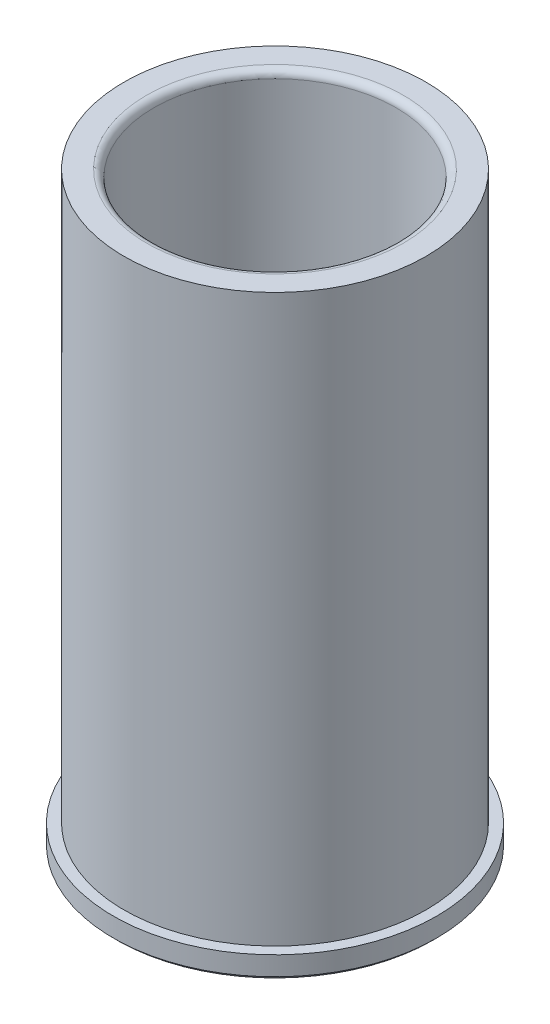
from build123d import *

# Parameters (mm, degrees)
FILLET1_R = 1.524


with BuildPart() as part:
    # Sketch1 → Revolve1 (revolve)
    with BuildSketch(Plane.XY, mode=Mode.PRIVATE) as revolve1_sk:
        Polygon((-33.2359, 0), (-33.9979, 0.762), (-33.9979, 4.7625), (-31.75635, 4.7625), (-31.75635, 123.825), (-25.4635, 123.825), (-25.4635, 0.762), (-26.2255, 0), align=None)
    revolve(revolve1_sk.sketch.rotate(Axis((0, -1000, 0), (0, 1, 0)), 180), axis=Axis((0, -1000, 0), (0, 1, 0)))

    # Fillet1
    fillet1_edges = [part.edges().sort_by_distance(p)[0] for p in [
        (-25.4635, 123.825, 0),
    ]]
    fillet(fillet1_edges, radius=FILLET1_R)


solid = part.part
